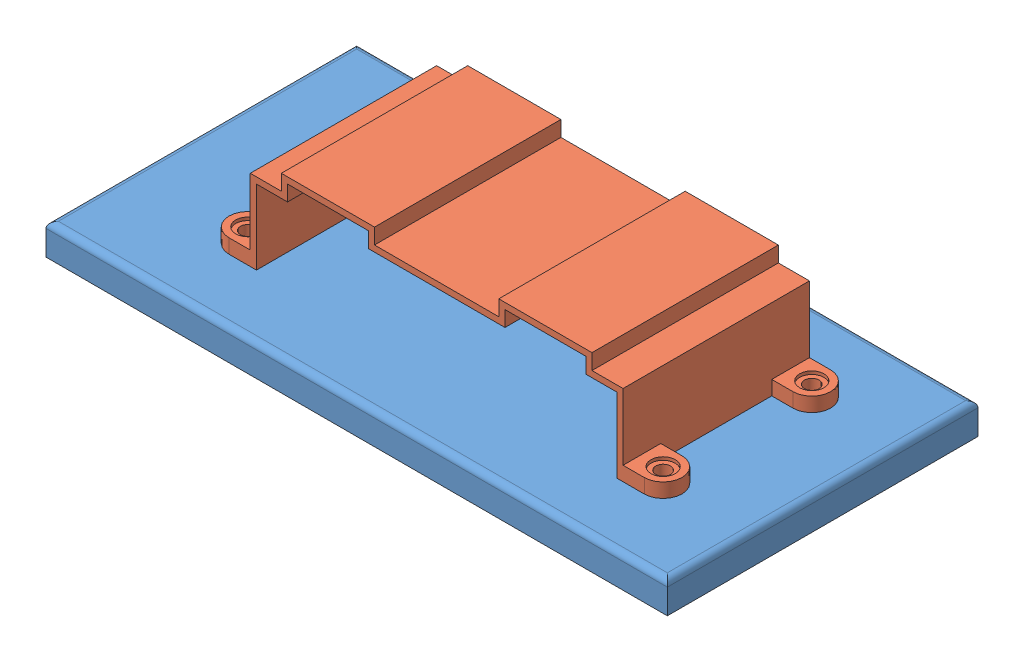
SolidWorks assembly Hole Allignment.SLDASM, configuration Default (file format 3693). Lengths in mm.
Overall size (254 52.07 127).
2 component instances, 2 part files, 3 mates.
Components (placement in the parent):
- base-1: base.SLDPRT [Default] at (103.2786 -58.8328 -14.5286) size (254 12.7 127)
- hold-1: hold.SLDPRT [Default] at (-16.7457 -46.1328 -116.448) size (185.16 39.37 76.2)
Mates (geometry in assembly coordinates):
- Coincident1: coincident anti-aligned: plane of base-1 through (103.2786 -46.1328 -141.5286) normal (0 1 0); plane of hold-1 through (59.4543 -46.1328 -40.248) normal (0 -1 0)
- Concentric1: concentric aligned: cylinder of base-1; cylinder of hold-1
- Parallel1: parallel aligned: plane of base-1 through (103.2786 -46.1328 -141.5286) normal (0 0 -1); plane of hold-1 through (46.7543 -6.7628 -116.448) normal (0 0 -1)
